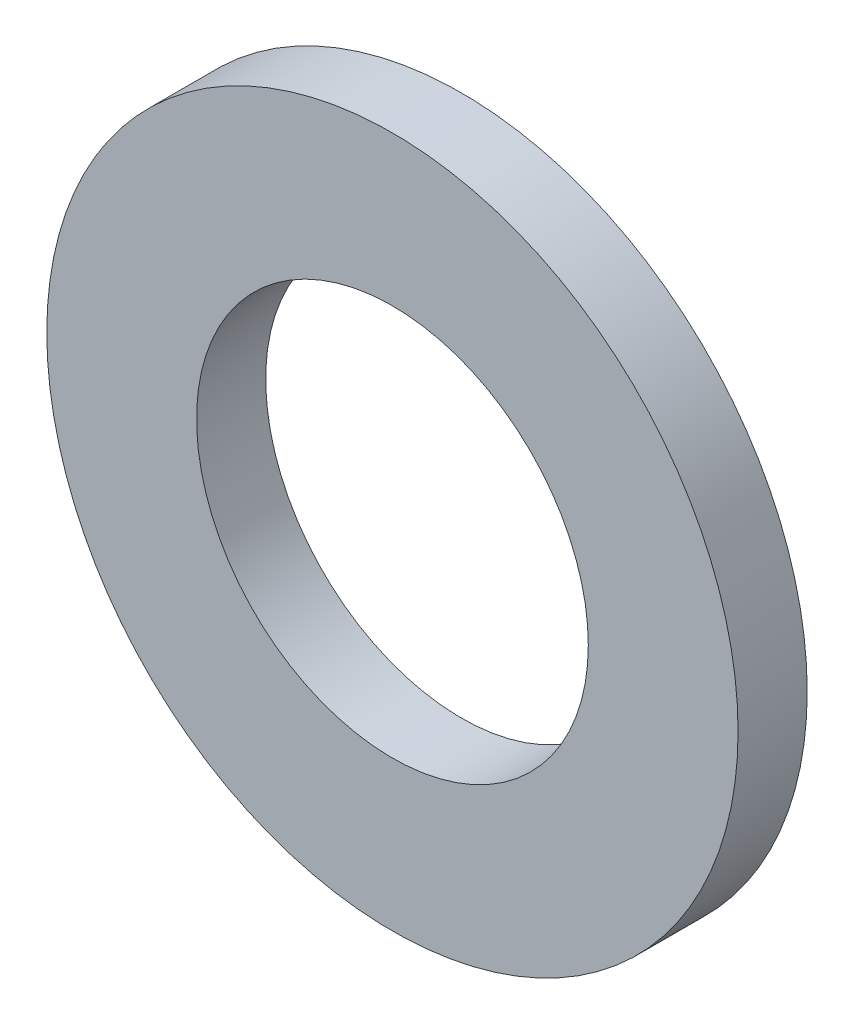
from build123d import *

# Parameters (mm, degrees)
ESQUISSE1_R      = 15
ESQUISSE1_R_2    = 8.5
EXTRUSION1_DEPTH = 3


with BuildPart() as part:
    # Esquisse1 → Extrusion1 (new body)
    with BuildSketch(Plane.XY):
        Circle(ESQUISSE1_R)
        Circle(ESQUISSE1_R_2, mode=Mode.SUBTRACT)
    extrude(amount=EXTRUSION1_DEPTH)


solid = part.part
